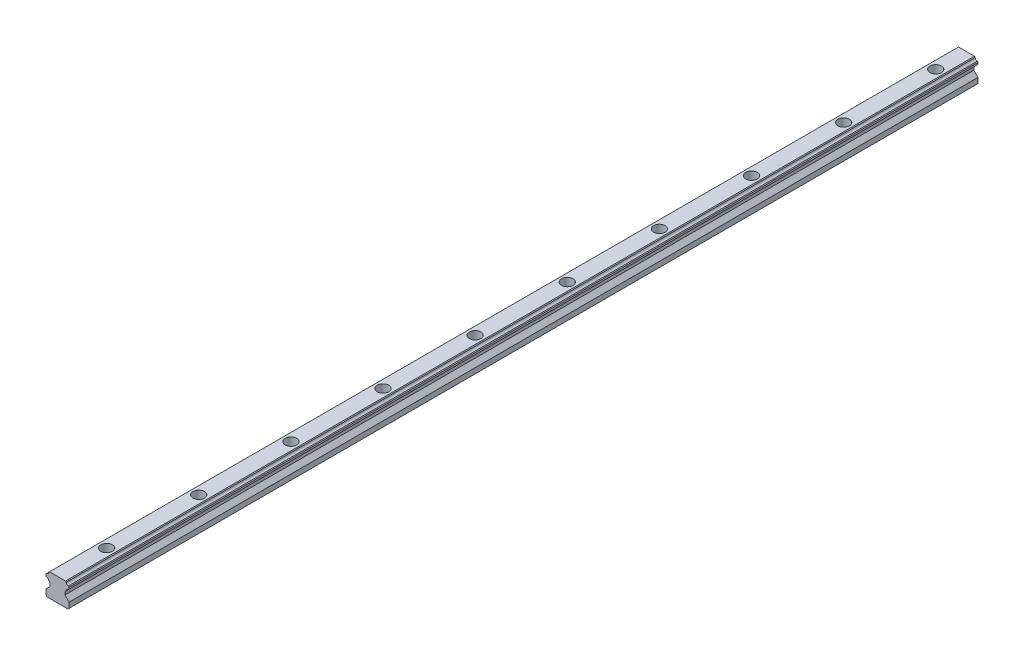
from build123d import *

# Parameters (mm, degrees)
EXTRUDE_1_DEPTH             = 592
HOLE_WIZARD_M41_D           = 4.5
HOLE_WIZARD_M41_CBORE_D     = 7.5
HOLE_WIZARD_M41_CBORE_DEPTH = 5.3


with BuildPart() as part:
    # Sketch 1 → Extrude 1 (new body)
    with BuildSketch(Plane.XY):
        with BuildLine():
            Line((2.444261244, 15.03179722), (12.844261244, 15.03179722))
            Line((12.844261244, 15.03179722), (13.302053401, 14.574005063))
            ThreePointArc((13.302053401, 14.574005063), (13.757791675, 13.645327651), (14.686469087, 13.189589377))
            Line((14.686469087, 13.189589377), (15.144261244, 12.73179722))
            Line((15.144261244, 12.73179722), (15.144261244, 11.53179722))
            Line((15.144261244, 11.53179722), (14.686469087, 11.074005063))
            ThreePointArc((14.686469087, 11.074005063), (13.757791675, 10.618266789), (13.302053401, 9.689589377))
            Line((13.302053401, 9.689589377), (12.444261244, 8.83179722))
            Line((12.444261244, 8.83179722), (12.444261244, 6.93179722))
            Line((12.444261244, 6.93179722), (15.144261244, 4.23179722))
            Line((15.144261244, 4.23179722), (15.144261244, 0.73179722))
            Line((15.144261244, 0.73179722), (14.444261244, 0.03179722))
            Line((14.444261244, 0.03179722), (0.844261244, 0.03179722))
            Line((0.844261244, 0.03179722), (0.144261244, 0.73179722))
            Line((0.144261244, 0.73179722), (0.144261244, 4.23179722))
            Line((0.144261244, 4.23179722), (2.844261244, 6.93179722))
            Line((2.844261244, 6.93179722), (2.844261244, 8.83179722))
            Line((2.844261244, 8.83179722), (1.986469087, 9.689589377))
            ThreePointArc((1.986469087, 9.689589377), (1.530730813, 10.618266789), (0.602053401, 11.074005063))
            Line((0.602053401, 11.074005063), (0.144261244, 11.53179722))
            Line((0.144261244, 11.53179722), (0.144261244, 12.73179722))
            Line((0.144261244, 12.73179722), (0.602053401, 13.189589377))
            ThreePointArc((0.602053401, 13.189589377), (1.530730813, 13.645327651), (1.986469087, 14.574005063))
            Line((1.986469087, 14.574005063), (2.444261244, 15.03179722))
        make_face()
    extrude(amount=EXTRUDE_1_DEPTH)

    # Hole Wizard M41 (through all)
    with Locations(Plane(origin=(0, 15.03179722, 0), x_dir=(-1, 0, 0), z_dir=(0, 1, 0))):
        with Locations((-7.644261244, 20), (-7.644261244, 80), (-7.644261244, 140), (-7.644261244, 200), (-7.644261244, 260), (-7.644261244, 320), (-7.644261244, 380), (-7.644261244, 440), (-7.644261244, 500), (-7.644261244, 560), (-7.644261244, 620), (-7.644261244, 680), (-7.644261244, 740), (-7.644261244, 800), (-7.644261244, 860), (-7.644261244, 920), (-7.644261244, 980), (-7.644261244, 1040)):
            CounterBoreHole(HOLE_WIZARD_M41_D / 2, HOLE_WIZARD_M41_CBORE_D / 2, HOLE_WIZARD_M41_CBORE_DEPTH)


solid = part.part
